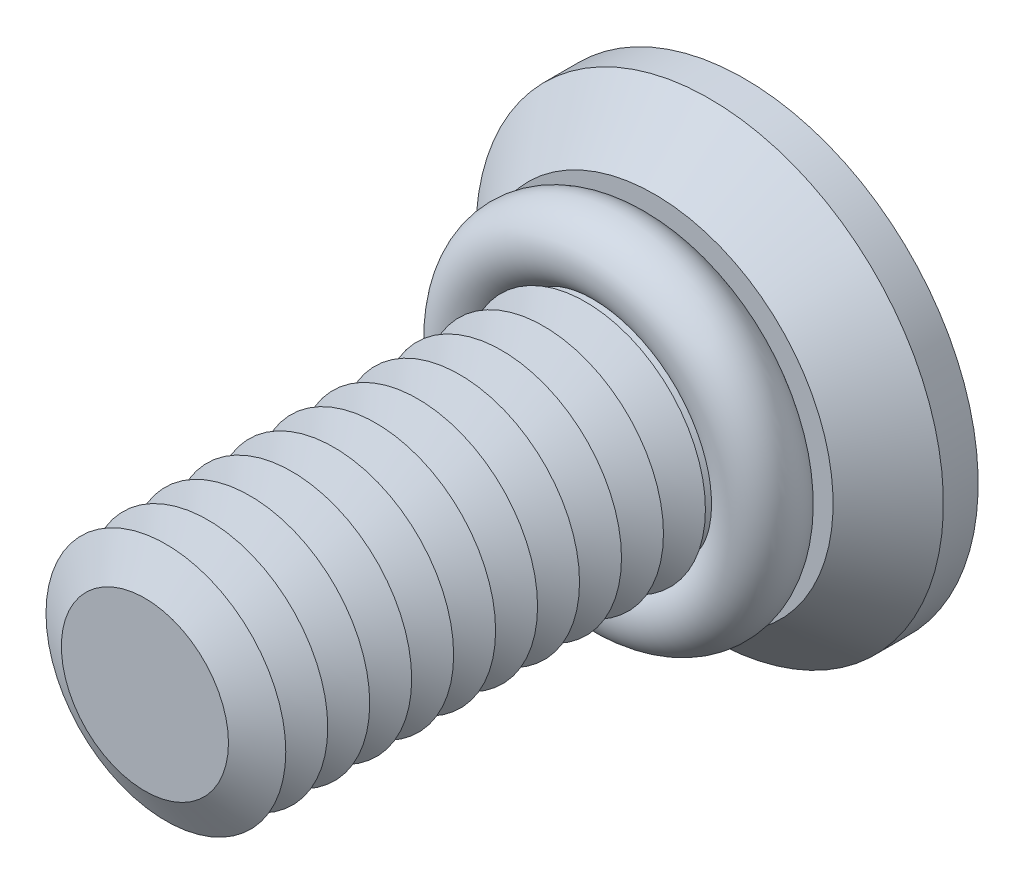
ISO-10303-21;
HEADER;
FILE_DESCRIPTION(('STEP AP214'),'2;1');
FILE_NAME('part.step','',(''),(''),'','','');
FILE_SCHEMA(('AUTOMOTIVE_DESIGN { 1 0 10303 214 1 1 1 1 }'));
ENDSEC;
DATA;
#1=APPLICATION_CONTEXT('core data for automotive mechanical design processes');
#2=APPLICATION_PROTOCOL_DEFINITION('international standard','automotive_design',2000,#1);
#3=PRODUCT_CONTEXT('',#1,'mechanical');
#4=PRODUCT('Part','Part','',(#3));
#5=PRODUCT_RELATED_PRODUCT_CATEGORY('part','',(#4));
#6=PRODUCT_DEFINITION_FORMATION('','',#4);
#7=PRODUCT_DEFINITION_CONTEXT('part definition',#1,'design');
#8=PRODUCT_DEFINITION('design','',#6,#7);
#9=PRODUCT_DEFINITION_SHAPE('','',#8);
#10=(LENGTH_UNIT() NAMED_UNIT(*) SI_UNIT(.MILLI.,.METRE.));
#11=(NAMED_UNIT(*) PLANE_ANGLE_UNIT() SI_UNIT($,.RADIAN.));
#12=(NAMED_UNIT(*) SI_UNIT($,.STERADIAN.) SOLID_ANGLE_UNIT());
#13=UNCERTAINTY_MEASURE_WITH_UNIT(LENGTH_MEASURE(1.E-05),#10,'distance_accuracy_value','');
#14=(GEOMETRIC_REPRESENTATION_CONTEXT(3) GLOBAL_UNCERTAINTY_ASSIGNED_CONTEXT((#13)) GLOBAL_UNIT_ASSIGNED_CONTEXT((#10,
#11,#12)) REPRESENTATION_CONTEXT('',''));
#15=CARTESIAN_POINT('',(0.,0.,0.));
#16=DIRECTION('',(0.,0.,1.));
#17=DIRECTION('',(1.,0.,0.));
#18=AXIS2_PLACEMENT_3D('',#15,#16,#17);
#19=CARTESIAN_POINT('',(0.,0.,2.1));
#20=DIRECTION('',(0.,0.,1.));
#21=DIRECTION('',(1.,0.,0.));
#22=AXIS2_PLACEMENT_3D('',#19,#20,#21);
#23=TOROIDAL_SURFACE('',#22,2.4,0.6);
#24=CARTESIAN_POINT('',(0.,2.4,2.1));
#25=DIRECTION('',(1.,0.,0.));
#26=DIRECTION('',(0.,0.,-1.));
#27=AXIS2_PLACEMENT_3D('',#24,#25,#26);
#28=CIRCLE('',#27,0.6);
#29=CARTESIAN_POINT('',(0.,3.,2.1));
#30=VERTEX_POINT('',#29);
#31=EDGE_CURVE('P0_E10',#30,#30,#28,.T.);
#32=CARTESIAN_POINT('',(0.,0.,2.1));
#33=DIRECTION('',(0.,0.,1.));
#34=DIRECTION('',(1.,0.,0.));
#35=AXIS2_PLACEMENT_3D('',#32,#33,#34);
#36=CIRCLE('',#35,3.);
#37=EDGE_CURVE('',#30,#30,#36,.T.);
#38=ORIENTED_EDGE('',*,*,#31,.F.);
#39=ORIENTED_EDGE('',*,*,#31,.T.);
#40=ORIENTED_EDGE('',*,*,#37,.T.);
#41=ORIENTED_EDGE('',*,*,#37,.F.);
#42=EDGE_LOOP('',(#38,#40,#39,#41));
#43=FACE_BOUND('',#42,.T.);
#44=ADVANCED_FACE('P0_F14',(#43),#23,.T.);
#45=CLOSED_SHELL('',(#44));
#46=MANIFOLD_SOLID_BREP('P0_B1',#45);
#47=CARTESIAN_POINT('',(0.,0.,6.5));
#48=DIRECTION('',(0.,0.,-1.));
#49=DIRECTION('',(-1.,0.,0.));
#50=AXIS2_PLACEMENT_3D('',#47,#48,#49);
#51=CONICAL_SURFACE('',#50,1.39378221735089,1.0471975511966);
#52=CARTESIAN_POINT('',(0.,0.,6.15));
#53=DIRECTION('',(0.,0.,1.));
#54=DIRECTION('',(1.,0.,0.));
#55=AXIS2_PLACEMENT_3D('',#52,#53,#54);
#56=CIRCLE('',#55,2.);
#57=CARTESIAN_POINT('',(2.,0.,6.15));
#58=VERTEX_POINT('',#57);
#59=EDGE_CURVE('P1_E324',#58,#58,#56,.T.);
#60=ORIENTED_EDGE('',*,*,#59,.T.);
#61=EDGE_LOOP('',(#60));
#62=FACE_BOUND('',#61,.T.);
#63=CARTESIAN_POINT('',(0.,0.,6.5));
#64=DIRECTION('',(0.,0.,1.));
#65=DIRECTION('',(1.,0.,0.));
#66=AXIS2_PLACEMENT_3D('',#63,#64,#65);
#67=CIRCLE('',#66,1.39378221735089);
#68=CARTESIAN_POINT('',(1.39378221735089,0.,6.5));
#69=VERTEX_POINT('',#68);
#70=EDGE_CURVE('P1_E321',#69,#69,#67,.T.);
#71=ORIENTED_EDGE('',*,*,#70,.F.);
#72=EDGE_LOOP('',(#71));
#73=FACE_BOUND('',#72,.T.);
#74=ADVANCED_FACE('P1_F15',(#62,#73),#51,.T.);
#75=CARTESIAN_POINT('',(0.,0.,6.85));
#76=DIRECTION('',(0.,0.,1.));
#77=DIRECTION('',(1.,0.,0.));
#78=AXIS2_PLACEMENT_3D('',#75,#76,#77);
#79=CONICAL_SURFACE('',#78,2.,1.0471975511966);
#80=ORIENTED_EDGE('',*,*,#70,.T.);
#81=EDGE_LOOP('',(#80));
#82=FACE_BOUND('',#81,.T.);
#83=CARTESIAN_POINT('',(0.,0.,6.85));
#84=DIRECTION('',(0.,0.,1.));
#85=DIRECTION('',(1.,0.,0.));
#86=AXIS2_PLACEMENT_3D('',#83,#84,#85);
#87=CIRCLE('',#86,2.);
#88=CARTESIAN_POINT('',(2.,0.,6.85));
#89=VERTEX_POINT('',#88);
#90=EDGE_CURVE('P1_E318',#89,#89,#87,.T.);
#91=ORIENTED_EDGE('',*,*,#90,.F.);
#92=EDGE_LOOP('',(#91));
#93=FACE_BOUND('',#92,.T.);
#94=ADVANCED_FACE('P1_F245',(#82,#93),#79,.T.);
#95=CARTESIAN_POINT('',(0.,0.,10.));
#96=DIRECTION('',(0.,0.,1.));
#97=DIRECTION('',(1.,0.,0.));
#98=AXIS2_PLACEMENT_3D('',#95,#96,#97);
#99=PLANE('',#98);
#100=CARTESIAN_POINT('',(0.,0.,10.));
#101=DIRECTION('',(0.,0.,1.));
#102=DIRECTION('',(1.,0.,0.));
#103=AXIS2_PLACEMENT_3D('',#100,#101,#102);
#104=CIRCLE('',#103,1.39378221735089);
#105=CARTESIAN_POINT('',(1.39378221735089,0.,10.));
#106=VERTEX_POINT('',#105);
#107=EDGE_CURVE('P1_E131',#106,#106,#104,.T.);
#108=ORIENTED_EDGE('',*,*,#107,.T.);
#109=EDGE_LOOP('',(#108));
#110=FACE_BOUND('',#109,.T.);
#111=ADVANCED_FACE('P1_F251',(#110),#99,.T.);
#112=CARTESIAN_POINT('',(0.,0.,10.));
#113=DIRECTION('',(0.,0.,-1.));
#114=DIRECTION('',(-1.,0.,0.));
#115=AXIS2_PLACEMENT_3D('',#112,#113,#114);
#116=CONICAL_SURFACE('',#115,1.39378221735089,1.0471975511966);
#117=CARTESIAN_POINT('',(0.,0.,9.65));
#118=DIRECTION('',(0.,0.,1.));
#119=DIRECTION('',(1.,0.,0.));
#120=AXIS2_PLACEMENT_3D('',#117,#118,#119);
#121=CIRCLE('',#120,2.);
#122=CARTESIAN_POINT('',(2.,0.,9.65));
#123=VERTEX_POINT('',#122);
#124=EDGE_CURVE('P1_E133',#123,#123,#121,.T.);
#125=ORIENTED_EDGE('',*,*,#124,.T.);
#126=EDGE_LOOP('',(#125));
#127=FACE_BOUND('',#126,.T.);
#128=ORIENTED_EDGE('',*,*,#107,.F.);
#129=EDGE_LOOP('',(#128));
#130=FACE_BOUND('',#129,.T.);
#131=ADVANCED_FACE('P1_F196',(#127,#130),#116,.T.);
#132=CARTESIAN_POINT('',(0.,0.,9.65));
#133=DIRECTION('',(0.,0.,1.));
#134=DIRECTION('',(1.,0.,0.));
#135=AXIS2_PLACEMENT_3D('',#132,#133,#134);
#136=CONICAL_SURFACE('',#135,2.,1.0471975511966);
#137=CARTESIAN_POINT('',(0.,0.,9.3));
#138=DIRECTION('',(0.,0.,1.));
#139=DIRECTION('',(1.,0.,0.));
#140=AXIS2_PLACEMENT_3D('',#137,#138,#139);
#141=CIRCLE('',#140,1.39378221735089);
#142=CARTESIAN_POINT('',(1.39378221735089,0.,9.3));
#143=VERTEX_POINT('',#142);
#144=EDGE_CURVE('P1_E297',#143,#143,#141,.T.);
#145=ORIENTED_EDGE('',*,*,#144,.T.);
#146=EDGE_LOOP('',(#145));
#147=FACE_BOUND('',#146,.T.);
#148=ORIENTED_EDGE('',*,*,#124,.F.);
#149=EDGE_LOOP('',(#148));
#150=FACE_BOUND('',#149,.T.);
#151=ADVANCED_FACE('P1_F284',(#147,#150),#136,.T.);
#152=CARTESIAN_POINT('',(0.,0.,9.3));
#153=DIRECTION('',(0.,0.,-1.));
#154=DIRECTION('',(-1.,0.,0.));
#155=AXIS2_PLACEMENT_3D('',#152,#153,#154);
#156=CONICAL_SURFACE('',#155,1.39378221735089,1.0471975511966);
#157=CARTESIAN_POINT('',(0.,0.,8.95));
#158=DIRECTION('',(0.,0.,1.));
#159=DIRECTION('',(1.,0.,0.));
#160=AXIS2_PLACEMENT_3D('',#157,#158,#159);
#161=CIRCLE('',#160,2.);
#162=CARTESIAN_POINT('',(2.,0.,8.95));
#163=VERTEX_POINT('',#162);
#164=EDGE_CURVE('P1_E294',#163,#163,#161,.T.);
#165=ORIENTED_EDGE('',*,*,#164,.T.);
#166=EDGE_LOOP('',(#165));
#167=FACE_BOUND('',#166,.T.);
#168=ORIENTED_EDGE('',*,*,#144,.F.);
#169=EDGE_LOOP('',(#168));
#170=FACE_BOUND('',#169,.T.);
#171=ADVANCED_FACE('P1_F279',(#167,#170),#156,.T.);
#172=CARTESIAN_POINT('',(0.,0.,8.95));
#173=DIRECTION('',(0.,0.,1.));
#174=DIRECTION('',(1.,0.,0.));
#175=AXIS2_PLACEMENT_3D('',#172,#173,#174);
#176=CONICAL_SURFACE('',#175,2.,1.0471975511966);
#177=CARTESIAN_POINT('',(0.,0.,8.6));
#178=DIRECTION('',(0.,0.,1.));
#179=DIRECTION('',(1.,0.,0.));
#180=AXIS2_PLACEMENT_3D('',#177,#178,#179);
#181=CIRCLE('',#180,1.39378221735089);
#182=CARTESIAN_POINT('',(1.39378221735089,0.,8.6));
#183=VERTEX_POINT('',#182);
#184=EDGE_CURVE('P1_E301',#183,#183,#181,.T.);
#185=ORIENTED_EDGE('',*,*,#184,.T.);
#186=EDGE_LOOP('',(#185));
#187=FACE_BOUND('',#186,.T.);
#188=ORIENTED_EDGE('',*,*,#164,.F.);
#189=EDGE_LOOP('',(#188));
#190=FACE_BOUND('',#189,.T.);
#191=ADVANCED_FACE('P1_F276',(#187,#190),#176,.T.);
#192=CARTESIAN_POINT('',(0.,0.,8.6));
#193=DIRECTION('',(0.,0.,-1.));
#194=DIRECTION('',(-1.,0.,0.));
#195=AXIS2_PLACEMENT_3D('',#192,#193,#194);
#196=CONICAL_SURFACE('',#195,1.39378221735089,1.0471975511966);
#197=CARTESIAN_POINT('',(0.,0.,8.25));
#198=DIRECTION('',(0.,0.,1.));
#199=DIRECTION('',(1.,0.,0.));
#200=AXIS2_PLACEMENT_3D('',#197,#198,#199);
#201=CIRCLE('',#200,2.);
#202=CARTESIAN_POINT('',(2.,0.,8.25));
#203=VERTEX_POINT('',#202);
#204=EDGE_CURVE('P1_E306',#203,#203,#201,.T.);
#205=ORIENTED_EDGE('',*,*,#204,.T.);
#206=EDGE_LOOP('',(#205));
#207=FACE_BOUND('',#206,.T.);
#208=ORIENTED_EDGE('',*,*,#184,.F.);
#209=EDGE_LOOP('',(#208));
#210=FACE_BOUND('',#209,.T.);
#211=ADVANCED_FACE('P1_F271',(#207,#210),#196,.T.);
#212=CARTESIAN_POINT('',(0.,0.,8.25));
#213=DIRECTION('',(0.,0.,1.));
#214=DIRECTION('',(1.,0.,0.));
#215=AXIS2_PLACEMENT_3D('',#212,#213,#214);
#216=CONICAL_SURFACE('',#215,2.,1.0471975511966);
#217=CARTESIAN_POINT('',(0.,0.,7.9));
#218=DIRECTION('',(0.,0.,1.));
#219=DIRECTION('',(1.,0.,0.));
#220=AXIS2_PLACEMENT_3D('',#217,#218,#219);
#221=CIRCLE('',#220,1.39378221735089);
#222=CARTESIAN_POINT('',(1.39378221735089,0.,7.9));
#223=VERTEX_POINT('',#222);
#224=EDGE_CURVE('P1_E309',#223,#223,#221,.T.);
#225=ORIENTED_EDGE('',*,*,#224,.T.);
#226=EDGE_LOOP('',(#225));
#227=FACE_BOUND('',#226,.T.);
#228=ORIENTED_EDGE('',*,*,#204,.F.);
#229=EDGE_LOOP('',(#228));
#230=FACE_BOUND('',#229,.T.);
#231=ADVANCED_FACE('P1_F268',(#227,#230),#216,.T.);
#232=CARTESIAN_POINT('',(0.,0.,7.9));
#233=DIRECTION('',(0.,0.,-1.));
#234=DIRECTION('',(-1.,0.,0.));
#235=AXIS2_PLACEMENT_3D('',#232,#233,#234);
#236=CONICAL_SURFACE('',#235,1.39378221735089,1.0471975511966);
#237=CARTESIAN_POINT('',(0.,0.,7.55));
#238=DIRECTION('',(0.,0.,1.));
#239=DIRECTION('',(1.,0.,0.));
#240=AXIS2_PLACEMENT_3D('',#237,#238,#239);
#241=CIRCLE('',#240,2.);
#242=CARTESIAN_POINT('',(2.,0.,7.55));
#243=VERTEX_POINT('',#242);
#244=EDGE_CURVE('P1_E312',#243,#243,#241,.T.);
#245=ORIENTED_EDGE('',*,*,#244,.T.);
#246=EDGE_LOOP('',(#245));
#247=FACE_BOUND('',#246,.T.);
#248=ORIENTED_EDGE('',*,*,#224,.F.);
#249=EDGE_LOOP('',(#248));
#250=FACE_BOUND('',#249,.T.);
#251=ADVANCED_FACE('P1_F262',(#247,#250),#236,.T.);
#252=CARTESIAN_POINT('',(0.,0.,7.55));
#253=DIRECTION('',(0.,0.,1.));
#254=DIRECTION('',(1.,0.,0.));
#255=AXIS2_PLACEMENT_3D('',#252,#253,#254);
#256=CONICAL_SURFACE('',#255,2.,1.0471975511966);
#257=CARTESIAN_POINT('',(0.,0.,7.2));
#258=DIRECTION('',(0.,0.,1.));
#259=DIRECTION('',(1.,0.,0.));
#260=AXIS2_PLACEMENT_3D('',#257,#258,#259);
#261=CIRCLE('',#260,1.39378221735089);
#262=CARTESIAN_POINT('',(1.39378221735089,0.,7.2));
#263=VERTEX_POINT('',#262);
#264=EDGE_CURVE('P1_E315',#263,#263,#261,.T.);
#265=ORIENTED_EDGE('',*,*,#264,.T.);
#266=EDGE_LOOP('',(#265));
#267=FACE_BOUND('',#266,.T.);
#268=ORIENTED_EDGE('',*,*,#244,.F.);
#269=EDGE_LOOP('',(#268));
#270=FACE_BOUND('',#269,.T.);
#271=ADVANCED_FACE('P1_F258',(#267,#270),#256,.T.);
#272=CARTESIAN_POINT('',(0.,0.,7.2));
#273=DIRECTION('',(0.,0.,-1.));
#274=DIRECTION('',(-1.,0.,0.));
#275=AXIS2_PLACEMENT_3D('',#272,#273,#274);
#276=CONICAL_SURFACE('',#275,1.39378221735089,1.0471975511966);
#277=ORIENTED_EDGE('',*,*,#90,.T.);
#278=EDGE_LOOP('',(#277));
#279=FACE_BOUND('',#278,.T.);
#280=ORIENTED_EDGE('',*,*,#264,.F.);
#281=EDGE_LOOP('',(#280));
#282=FACE_BOUND('',#281,.T.);
#283=ADVANCED_FACE('P1_F261',(#279,#282),#276,.T.);
#284=CARTESIAN_POINT('',(0.,0.,5.8));
#285=DIRECTION('',(0.,0.,-1.));
#286=DIRECTION('',(-1.,0.,0.));
#287=AXIS2_PLACEMENT_3D('',#284,#285,#286);
#288=CONICAL_SURFACE('',#287,1.39378221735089,1.0471975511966);
#289=CARTESIAN_POINT('',(0.,0.,5.45));
#290=DIRECTION('',(0.,0.,1.));
#291=DIRECTION('',(1.,0.,0.));
#292=AXIS2_PLACEMENT_3D('',#289,#290,#291);
#293=CIRCLE('',#292,2.);
#294=CARTESIAN_POINT('',(2.,0.,5.45));
#295=VERTEX_POINT('',#294);
#296=EDGE_CURVE('P1_E329',#295,#295,#293,.T.);
#297=ORIENTED_EDGE('',*,*,#296,.T.);
#298=EDGE_LOOP('',(#297));
#299=FACE_BOUND('',#298,.T.);
#300=CARTESIAN_POINT('',(0.,0.,5.8));
#301=DIRECTION('',(0.,0.,1.));
#302=DIRECTION('',(1.,0.,0.));
#303=AXIS2_PLACEMENT_3D('',#300,#301,#302);
#304=CIRCLE('',#303,1.39378221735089);
#305=CARTESIAN_POINT('',(1.39378221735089,0.,5.8));
#306=VERTEX_POINT('',#305);
#307=EDGE_CURVE('P1_E326',#306,#306,#304,.T.);
#308=ORIENTED_EDGE('',*,*,#307,.F.);
#309=EDGE_LOOP('',(#308));
#310=FACE_BOUND('',#309,.T.);
#311=ADVANCED_FACE('P1_F266',(#299,#310),#288,.T.);
#312=CARTESIAN_POINT('',(0.,0.,6.15));
#313=DIRECTION('',(0.,0.,1.));
#314=DIRECTION('',(1.,0.,0.));
#315=AXIS2_PLACEMENT_3D('',#312,#313,#314);
#316=CONICAL_SURFACE('',#315,2.,1.0471975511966);
#317=ORIENTED_EDGE('',*,*,#307,.T.);
#318=EDGE_LOOP('',(#317));
#319=FACE_BOUND('',#318,.T.);
#320=ORIENTED_EDGE('',*,*,#59,.F.);
#321=EDGE_LOOP('',(#320));
#322=FACE_BOUND('',#321,.T.);
#323=ADVANCED_FACE('P1_F461',(#319,#322),#316,.T.);
#324=CARTESIAN_POINT('',(0.,0.,5.1));
#325=DIRECTION('',(0.,0.,-1.));
#326=DIRECTION('',(-1.,0.,0.));
#327=AXIS2_PLACEMENT_3D('',#324,#325,#326);
#328=CONICAL_SURFACE('',#327,1.39378221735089,1.0471975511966);
#329=CARTESIAN_POINT('',(0.,0.,4.75));
#330=DIRECTION('',(0.,0.,1.));
#331=DIRECTION('',(1.,0.,0.));
#332=AXIS2_PLACEMENT_3D('',#329,#330,#331);
#333=CIRCLE('',#332,2.);
#334=CARTESIAN_POINT('',(2.,0.,4.75));
#335=VERTEX_POINT('',#334);
#336=EDGE_CURVE('P1_E335',#335,#335,#333,.T.);
#337=ORIENTED_EDGE('',*,*,#336,.T.);
#338=EDGE_LOOP('',(#337));
#339=FACE_BOUND('',#338,.T.);
#340=CARTESIAN_POINT('',(0.,0.,5.1));
#341=DIRECTION('',(0.,0.,1.));
#342=DIRECTION('',(1.,0.,0.));
#343=AXIS2_PLACEMENT_3D('',#340,#341,#342);
#344=CIRCLE('',#343,1.39378221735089);
#345=CARTESIAN_POINT('',(1.39378221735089,0.,5.1));
#346=VERTEX_POINT('',#345);
#347=EDGE_CURVE('P1_E332',#346,#346,#344,.T.);
#348=ORIENTED_EDGE('',*,*,#347,.F.);
#349=EDGE_LOOP('',(#348));
#350=FACE_BOUND('',#349,.T.);
#351=ADVANCED_FACE('P1_F470',(#339,#350),#328,.T.);
#352=CARTESIAN_POINT('',(0.,0.,5.45));
#353=DIRECTION('',(0.,0.,1.));
#354=DIRECTION('',(1.,0.,0.));
#355=AXIS2_PLACEMENT_3D('',#352,#353,#354);
#356=CONICAL_SURFACE('',#355,2.,1.0471975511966);
#357=ORIENTED_EDGE('',*,*,#347,.T.);
#358=EDGE_LOOP('',(#357));
#359=FACE_BOUND('',#358,.T.);
#360=ORIENTED_EDGE('',*,*,#296,.F.);
#361=EDGE_LOOP('',(#360));
#362=FACE_BOUND('',#361,.T.);
#363=ADVANCED_FACE('P1_F480',(#359,#362),#356,.T.);
#364=CARTESIAN_POINT('',(0.,0.,4.4));
#365=DIRECTION('',(0.,0.,-1.));
#366=DIRECTION('',(-1.,0.,0.));
#367=AXIS2_PLACEMENT_3D('',#364,#365,#366);
#368=CONICAL_SURFACE('',#367,1.39378221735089,1.0471975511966);
#369=CARTESIAN_POINT('',(0.,0.,4.05));
#370=DIRECTION('',(0.,0.,1.));
#371=DIRECTION('',(1.,0.,0.));
#372=AXIS2_PLACEMENT_3D('',#369,#370,#371);
#373=CIRCLE('',#372,2.);
#374=CARTESIAN_POINT('',(2.,0.,4.05));
#375=VERTEX_POINT('',#374);
#376=EDGE_CURVE('P1_E341',#375,#375,#373,.T.);
#377=ORIENTED_EDGE('',*,*,#376,.T.);
#378=EDGE_LOOP('',(#377));
#379=FACE_BOUND('',#378,.T.);
#380=CARTESIAN_POINT('',(0.,0.,4.4));
#381=DIRECTION('',(0.,0.,1.));
#382=DIRECTION('',(1.,0.,0.));
#383=AXIS2_PLACEMENT_3D('',#380,#381,#382);
#384=CIRCLE('',#383,1.39378221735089);
#385=CARTESIAN_POINT('',(1.39378221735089,0.,4.4));
#386=VERTEX_POINT('',#385);
#387=EDGE_CURVE('P1_E338',#386,#386,#384,.T.);
#388=ORIENTED_EDGE('',*,*,#387,.F.);
#389=EDGE_LOOP('',(#388));
#390=FACE_BOUND('',#389,.T.);
#391=ADVANCED_FACE('P1_F490',(#379,#390),#368,.T.);
#392=CARTESIAN_POINT('',(0.,0.,4.75));
#393=DIRECTION('',(0.,0.,1.));
#394=DIRECTION('',(1.,0.,0.));
#395=AXIS2_PLACEMENT_3D('',#392,#393,#394);
#396=CONICAL_SURFACE('',#395,2.,1.0471975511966);
#397=ORIENTED_EDGE('',*,*,#387,.T.);
#398=EDGE_LOOP('',(#397));
#399=FACE_BOUND('',#398,.T.);
#400=ORIENTED_EDGE('',*,*,#336,.F.);
#401=EDGE_LOOP('',(#400));
#402=FACE_BOUND('',#401,.T.);
#403=ADVANCED_FACE('P1_F500',(#399,#402),#396,.T.);
#404=CARTESIAN_POINT('',(0.,0.,3.7));
#405=DIRECTION('',(0.,0.,-1.));
#406=DIRECTION('',(-1.,0.,0.));
#407=AXIS2_PLACEMENT_3D('',#404,#405,#406);
#408=CONICAL_SURFACE('',#407,1.39378221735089,1.0471975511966);
#409=CARTESIAN_POINT('',(0.,0.,3.35));
#410=DIRECTION('',(0.,0.,1.));
#411=DIRECTION('',(1.,0.,0.));
#412=AXIS2_PLACEMENT_3D('',#409,#410,#411);
#413=CIRCLE('',#412,2.);
#414=CARTESIAN_POINT('',(2.,0.,3.35));
#415=VERTEX_POINT('',#414);
#416=EDGE_CURVE('P1_E347',#415,#415,#413,.T.);
#417=ORIENTED_EDGE('',*,*,#416,.T.);
#418=EDGE_LOOP('',(#417));
#419=FACE_BOUND('',#418,.T.);
#420=CARTESIAN_POINT('',(0.,0.,3.7));
#421=DIRECTION('',(0.,0.,1.));
#422=DIRECTION('',(1.,0.,0.));
#423=AXIS2_PLACEMENT_3D('',#420,#421,#422);
#424=CIRCLE('',#423,1.39378221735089);
#425=CARTESIAN_POINT('',(1.39378221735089,0.,3.7));
#426=VERTEX_POINT('',#425);
#427=EDGE_CURVE('P1_E344',#426,#426,#424,.T.);
#428=ORIENTED_EDGE('',*,*,#427,.F.);
#429=EDGE_LOOP('',(#428));
#430=FACE_BOUND('',#429,.T.);
#431=ADVANCED_FACE('P1_F510',(#419,#430),#408,.T.);
#432=CARTESIAN_POINT('',(0.,0.,4.05));
#433=DIRECTION('',(0.,0.,1.));
#434=DIRECTION('',(1.,0.,0.));
#435=AXIS2_PLACEMENT_3D('',#432,#433,#434);
#436=CONICAL_SURFACE('',#435,2.,1.0471975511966);
#437=ORIENTED_EDGE('',*,*,#427,.T.);
#438=EDGE_LOOP('',(#437));
#439=FACE_BOUND('',#438,.T.);
#440=ORIENTED_EDGE('',*,*,#376,.F.);
#441=EDGE_LOOP('',(#440));
#442=FACE_BOUND('',#441,.T.);
#443=ADVANCED_FACE('P1_F520',(#439,#442),#436,.T.);
#444=CARTESIAN_POINT('',(0.,0.,3.));
#445=DIRECTION('',(0.,0.,-1.));
#446=DIRECTION('',(-1.,0.,0.));
#447=AXIS2_PLACEMENT_3D('',#444,#445,#446);
#448=CONICAL_SURFACE('',#447,1.39378221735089,1.0471975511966);
#449=CARTESIAN_POINT('',(0.,0.,2.65));
#450=DIRECTION('',(0.,0.,1.));
#451=DIRECTION('',(1.,0.,0.));
#452=AXIS2_PLACEMENT_3D('',#449,#450,#451);
#453=CIRCLE('',#452,2.);
#454=CARTESIAN_POINT('',(2.,0.,2.65));
#455=VERTEX_POINT('',#454);
#456=EDGE_CURVE('P1_E353',#455,#455,#453,.T.);
#457=ORIENTED_EDGE('',*,*,#456,.T.);
#458=EDGE_LOOP('',(#457));
#459=FACE_BOUND('',#458,.T.);
#460=CARTESIAN_POINT('',(0.,0.,3.));
#461=DIRECTION('',(0.,0.,1.));
#462=DIRECTION('',(1.,0.,0.));
#463=AXIS2_PLACEMENT_3D('',#460,#461,#462);
#464=CIRCLE('',#463,1.39378221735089);
#465=CARTESIAN_POINT('',(1.39378221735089,0.,3.));
#466=VERTEX_POINT('',#465);
#467=EDGE_CURVE('P1_E350',#466,#466,#464,.T.);
#468=ORIENTED_EDGE('',*,*,#467,.F.);
#469=EDGE_LOOP('',(#468));
#470=FACE_BOUND('',#469,.T.);
#471=ADVANCED_FACE('P1_F530',(#459,#470),#448,.T.);
#472=CARTESIAN_POINT('',(0.,0.,3.35));
#473=DIRECTION('',(0.,0.,1.));
#474=DIRECTION('',(1.,0.,0.));
#475=AXIS2_PLACEMENT_3D('',#472,#473,#474);
#476=CONICAL_SURFACE('',#475,2.,1.0471975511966);
#477=ORIENTED_EDGE('',*,*,#467,.T.);
#478=EDGE_LOOP('',(#477));
#479=FACE_BOUND('',#478,.T.);
#480=ORIENTED_EDGE('',*,*,#416,.F.);
#481=EDGE_LOOP('',(#480));
#482=FACE_BOUND('',#481,.T.);
#483=ADVANCED_FACE('P1_F366',(#479,#482),#476,.T.);
#484=CARTESIAN_POINT('',(0.,0.,2.3));
#485=DIRECTION('',(0.,0.,-1.));
#486=DIRECTION('',(-1.,0.,0.));
#487=AXIS2_PLACEMENT_3D('',#484,#485,#486);
#488=CONICAL_SURFACE('',#487,1.39378221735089,1.0471975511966);
#489=CARTESIAN_POINT('',(0.,0.,2.3));
#490=DIRECTION('',(0.,0.,1.));
#491=DIRECTION('',(1.,0.,0.));
#492=AXIS2_PLACEMENT_3D('',#489,#490,#491);
#493=CIRCLE('',#492,1.39378221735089);
#494=CARTESIAN_POINT('',(1.39378221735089,0.,2.3));
#495=VERTEX_POINT('',#494);
#496=EDGE_CURVE('P1_E356',#495,#495,#493,.T.);
#497=ORIENTED_EDGE('',*,*,#496,.F.);
#498=EDGE_LOOP('',(#497));
#499=FACE_BOUND('',#498,.T.);
#500=CARTESIAN_POINT('',(0.,0.,2.06547005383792));
#501=DIRECTION('',(0.,0.,-1.));
#502=DIRECTION('',(-1.,0.,0.));
#503=AXIS2_PLACEMENT_3D('',#500,#501,#502);
#504=CIRCLE('',#503,1.8);
#505=CARTESIAN_POINT('',(-1.8,0.,2.06547005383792));
#506=VERTEX_POINT('',#505);
#507=EDGE_CURVE('P1_E19',#506,#506,#504,.F.);
#508=ORIENTED_EDGE('',*,*,#507,.T.);
#509=EDGE_LOOP('',(#508));
#510=FACE_BOUND('',#509,.T.);
#511=ADVANCED_FACE('P1_F363',(#499,#510),#488,.T.);
#512=CARTESIAN_POINT('',(0.,0.,2.65));
#513=DIRECTION('',(0.,0.,1.));
#514=DIRECTION('',(1.,0.,0.));
#515=AXIS2_PLACEMENT_3D('',#512,#513,#514);
#516=CONICAL_SURFACE('',#515,2.,1.0471975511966);
#517=ORIENTED_EDGE('',*,*,#496,.T.);
#518=EDGE_LOOP('',(#517));
#519=FACE_BOUND('',#518,.T.);
#520=ORIENTED_EDGE('',*,*,#456,.F.);
#521=EDGE_LOOP('',(#520));
#522=FACE_BOUND('',#521,.T.);
#523=ADVANCED_FACE('P1_F360',(#519,#522),#516,.T.);
#524=CARTESIAN_POINT('',(0.,0.,1.5));
#525=DIRECTION('',(0.,0.,-1.));
#526=DIRECTION('',(-1.,0.,0.));
#527=AXIS2_PLACEMENT_3D('',#524,#525,#526);
#528=CONICAL_SURFACE('',#527,1.25,1.0471975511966);
#529=CARTESIAN_POINT('',(0.,0.,2.22168783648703));
#530=VERTEX_POINT('',#529);
#531=VERTEX_LOOP('',#530);
#532=FACE_BOUND('',#531,.T.);
#533=CARTESIAN_POINT('',(0.,0.,1.5));
#534=DIRECTION('',(0.,0.,-1.));
#535=DIRECTION('',(-1.,0.,0.));
#536=AXIS2_PLACEMENT_3D('',#533,#534,#535);
#537=CIRCLE('',#536,1.25);
#538=CARTESIAN_POINT('',(-1.25,0.,1.5));
#539=VERTEX_POINT('',#538);
#540=CARTESIAN_POINT('',(-0.625,1.08253175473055,1.5));
#541=VERTEX_POINT('',#540);
#542=EDGE_CURVE('P1_E117',#539,#541,#537,.T.);
#543=ORIENTED_EDGE('',*,*,#542,.T.);
#544=CARTESIAN_POINT('',(0.,0.,1.5));
#545=DIRECTION('',(0.,0.,-1.));
#546=DIRECTION('',(-1.,0.,0.));
#547=AXIS2_PLACEMENT_3D('',#544,#545,#546);
#548=CIRCLE('',#547,1.25);
#549=CARTESIAN_POINT('',(0.625,1.08253175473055,1.5));
#550=VERTEX_POINT('',#549);
#551=EDGE_CURVE('P1_E24',#541,#550,#548,.T.);
#552=ORIENTED_EDGE('',*,*,#551,.T.);
#553=CARTESIAN_POINT('',(1.25,0.,1.5));
#554=VERTEX_POINT('',#553);
#555=EDGE_CURVE('P1_E765',#550,#554,#548,.T.);
#556=ORIENTED_EDGE('',*,*,#555,.T.);
#557=CARTESIAN_POINT('',(0.625,-1.08253175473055,1.5));
#558=VERTEX_POINT('',#557);
#559=EDGE_CURVE('P1_E758',#554,#558,#548,.T.);
#560=ORIENTED_EDGE('',*,*,#559,.T.);
#561=CARTESIAN_POINT('',(-0.625,-1.08253175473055,1.5));
#562=VERTEX_POINT('',#561);
#563=EDGE_CURVE('P1_E182',#558,#562,#548,.T.);
#564=ORIENTED_EDGE('',*,*,#563,.T.);
#565=EDGE_CURVE('P1_E179',#562,#539,#548,.T.);
#566=ORIENTED_EDGE('',*,*,#565,.T.);
#567=EDGE_LOOP('',(#543,#552,#556,#560,#564,#566));
#568=FACE_BOUND('',#567,.T.);
#569=ADVANCED_FACE('P1_F198',(#532,#568),#528,.F.);
#570=CARTESIAN_POINT('',(0.,0.,1.5));
#571=DIRECTION('',(0.,0.,-1.));
#572=DIRECTION('',(-1.,0.,0.));
#573=AXIS2_PLACEMENT_3D('',#570,#571,#572);
#574=PLANE('',#573);
#575=ORIENTED_EDGE('',*,*,#563,.F.);
#576=DIRECTION('',(-0.866025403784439,-0.5,0.));
#577=VECTOR('',#576,1.);
#578=CARTESIAN_POINT('',(1.25,-0.721687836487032,1.5));
#579=LINE('',#578,#577);
#580=CARTESIAN_POINT('',(0.,-1.44337567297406,1.5));
#581=VERTEX_POINT('',#580);
#582=EDGE_CURVE('P1_E774',#558,#581,#579,.T.);
#583=ORIENTED_EDGE('',*,*,#582,.T.);
#584=DIRECTION('',(-0.866025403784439,0.5,0.));
#585=VECTOR('',#584,1.);
#586=CARTESIAN_POINT('',(0.,-1.44337567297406,1.5));
#587=LINE('',#586,#585);
#588=EDGE_CURVE('P1_E781',#581,#562,#587,.T.);
#589=ORIENTED_EDGE('',*,*,#588,.T.);
#590=EDGE_LOOP('',(#575,#583,#589));
#591=FACE_BOUND('',#590,.T.);
#592=ADVANCED_FACE('P1_F572',(#591),#574,.T.);
#593=ORIENTED_EDGE('',*,*,#565,.F.);
#594=CARTESIAN_POINT('',(-1.25,-0.721687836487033,1.5));
#595=VERTEX_POINT('',#594);
#596=EDGE_CURVE('P1_E784',#562,#595,#587,.T.);
#597=ORIENTED_EDGE('',*,*,#596,.T.);
#598=DIRECTION('',(0.,1.,0.));
#599=VECTOR('',#598,1.);
#600=CARTESIAN_POINT('',(-1.25,-0.721687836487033,1.5));
#601=LINE('',#600,#599);
#602=EDGE_CURVE('P1_E123',#595,#539,#601,.T.);
#603=ORIENTED_EDGE('',*,*,#602,.T.);
#604=EDGE_LOOP('',(#593,#597,#603));
#605=FACE_BOUND('',#604,.T.);
#606=ADVANCED_FACE('P1_F231',(#605),#574,.T.);
#607=ORIENTED_EDGE('',*,*,#542,.F.);
#608=CARTESIAN_POINT('',(-1.25,0.721687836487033,1.5));
#609=VERTEX_POINT('',#608);
#610=EDGE_CURVE('P1_E786',#539,#609,#601,.T.);
#611=ORIENTED_EDGE('',*,*,#610,.T.);
#612=DIRECTION('',(0.866025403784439,0.5,0.));
#613=VECTOR('',#612,1.);
#614=CARTESIAN_POINT('',(-1.25,0.721687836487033,1.5));
#615=LINE('',#614,#613);
#616=EDGE_CURVE('P1_E789',#609,#541,#615,.T.);
#617=ORIENTED_EDGE('',*,*,#616,.T.);
#618=EDGE_LOOP('',(#607,#611,#617));
#619=FACE_BOUND('',#618,.T.);
#620=ADVANCED_FACE('P1_F589',(#619),#574,.T.);
#621=ORIENTED_EDGE('',*,*,#551,.F.);
#622=CARTESIAN_POINT('',(0.,1.44337567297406,1.5));
#623=VERTEX_POINT('',#622);
#624=EDGE_CURVE('P1_E788',#541,#623,#615,.T.);
#625=ORIENTED_EDGE('',*,*,#624,.T.);
#626=DIRECTION('',(0.866025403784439,-0.5,0.));
#627=VECTOR('',#626,1.);
#628=CARTESIAN_POINT('',(0.,1.44337567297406,1.5));
#629=LINE('',#628,#627);
#630=EDGE_CURVE('P1_E161',#623,#550,#629,.T.);
#631=ORIENTED_EDGE('',*,*,#630,.T.);
#632=EDGE_LOOP('',(#621,#625,#631));
#633=FACE_BOUND('',#632,.T.);
#634=ADVANCED_FACE('P1_F598',(#633),#574,.T.);
#635=ORIENTED_EDGE('',*,*,#555,.F.);
#636=CARTESIAN_POINT('',(1.25,0.721687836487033,1.5));
#637=VERTEX_POINT('',#636);
#638=EDGE_CURVE('P1_E773',#550,#637,#629,.T.);
#639=ORIENTED_EDGE('',*,*,#638,.T.);
#640=DIRECTION('',(0.,-1.,0.));
#641=VECTOR('',#640,1.);
#642=CARTESIAN_POINT('',(1.25,0.721687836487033,1.5));
#643=LINE('',#642,#641);
#644=EDGE_CURVE('P1_E768',#637,#554,#643,.T.);
#645=ORIENTED_EDGE('',*,*,#644,.T.);
#646=EDGE_LOOP('',(#635,#639,#645));
#647=FACE_BOUND('',#646,.T.);
#648=ADVANCED_FACE('P1_F607',(#647),#574,.T.);
#649=ORIENTED_EDGE('',*,*,#559,.F.);
#650=CARTESIAN_POINT('',(1.25,-0.721687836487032,1.5));
#651=VERTEX_POINT('',#650);
#652=EDGE_CURVE('P1_E760',#554,#651,#643,.T.);
#653=ORIENTED_EDGE('',*,*,#652,.T.);
#654=EDGE_CURVE('P1_E125',#651,#558,#579,.T.);
#655=ORIENTED_EDGE('',*,*,#654,.T.);
#656=EDGE_LOOP('',(#649,#653,#655));
#657=FACE_BOUND('',#656,.T.);
#658=ADVANCED_FACE('P1_F229',(#657),#574,.T.);
#659=CARTESIAN_POINT('',(1.25,-0.721687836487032,1.5));
#660=DIRECTION('',(0.5,-0.866025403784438,0.));
#661=DIRECTION('',(0.866025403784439,0.5,0.));
#662=AXIS2_PLACEMENT_3D('',#659,#660,#661);
#663=PLANE('',#662);
#664=DIRECTION('',(0.,0.,-1.));
#665=VECTOR('',#664,1.);
#666=CARTESIAN_POINT('',(1.25,-0.721687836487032,1.5));
#667=LINE('',#666,#665);
#668=CARTESIAN_POINT('',(1.25,-0.721687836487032,0.));
#669=VERTEX_POINT('',#668);
#670=EDGE_CURVE('P1_E164',#651,#669,#667,.T.);
#671=ORIENTED_EDGE('',*,*,#670,.T.);
#672=CARTESIAN_POINT('',(1.2502,-0.721572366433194,-3.09438201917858E-05));
#673=CARTESIAN_POINT('',(1.19827409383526,-0.75155180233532,0.00800698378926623));
#674=CARTESIAN_POINT('',(1.14625401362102,-0.781585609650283,0.0153042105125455));
#675=CARTESIAN_POINT('',(1.04203006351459,-0.841759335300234,0.028124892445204));
#676=CARTESIAN_POINT('',(0.989826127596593,-0.871899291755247,0.0336476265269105));
#677=CARTESIAN_POINT('',(0.88555111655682,-0.932102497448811,0.0425967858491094));
#678=CARTESIAN_POINT('',(0.833480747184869,-0.96216533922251,0.0460338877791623));
#679=CARTESIAN_POINT('',(0.729273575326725,-1.0223293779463,0.0506427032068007));
#680=CARTESIAN_POINT('',(0.677136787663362,-1.05243056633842,0.0518148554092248));
#681=CARTESIAN_POINT('',(0.572863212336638,-1.11263294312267,0.0518148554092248));
#682=CARTESIAN_POINT('',(0.520726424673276,-1.1427341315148,0.0506427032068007));
#683=CARTESIAN_POINT('',(0.416519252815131,-1.20289817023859,0.0460338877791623));
#684=CARTESIAN_POINT('',(0.36444888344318,-1.23296101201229,0.0425967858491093));
#685=CARTESIAN_POINT('',(0.260173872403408,-1.29316421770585,0.0336476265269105));
#686=CARTESIAN_POINT('',(0.207969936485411,-1.32330417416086,0.028124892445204));
#687=CARTESIAN_POINT('',(0.103745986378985,-1.38347789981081,0.0153042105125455));
#688=CARTESIAN_POINT('',(0.0517259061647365,-1.41351170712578,0.00800698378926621));
#689=CARTESIAN_POINT('',(-0.000199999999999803,-1.4434911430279,-3.09438201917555E-05));
#690=B_SPLINE_CURVE_WITH_KNOTS('',3,(#672,#673,#674,#675,#676,#677,#678,#679,#680,#681,#682,
#683,#684,#685,#686,#687,#688,#689),.UNSPECIFIED.,.F.,.F.,(4,2,2,2,2,2,2,2,4),(0.,
0.18149525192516,0.363064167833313,0.543695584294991,0.724292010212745,0.904888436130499,
1.08551985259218,1.26708876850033,1.44858402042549),.UNSPECIFIED.);
#691=CARTESIAN_POINT('',(0.,-1.44337567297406,0.));
#692=VERTEX_POINT('',#691);
#693=EDGE_CURVE('P1_E118',#669,#692,#690,.T.);
#694=ORIENTED_EDGE('',*,*,#693,.T.);
#695=DIRECTION('',(0.,0.,-1.));
#696=VECTOR('',#695,1.);
#697=CARTESIAN_POINT('',(0.,-1.44337567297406,1.5));
#698=LINE('',#697,#696);
#699=EDGE_CURVE('P1_E116',#581,#692,#698,.T.);
#700=ORIENTED_EDGE('',*,*,#699,.F.);
#701=ORIENTED_EDGE('',*,*,#582,.F.);
#702=ORIENTED_EDGE('',*,*,#654,.F.);
#703=EDGE_LOOP('',(#671,#694,#700,#701,#702));
#704=FACE_BOUND('',#703,.T.);
#705=ADVANCED_FACE('P1_F226',(#704),#663,.F.);
#706=CARTESIAN_POINT('',(0.,-1.44337567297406,1.5));
#707=DIRECTION('',(-0.5,-0.866025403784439,0.));
#708=DIRECTION('',(0.866025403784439,-0.5,0.));
#709=AXIS2_PLACEMENT_3D('',#706,#707,#708);
#710=PLANE('',#709);
#711=ORIENTED_EDGE('',*,*,#699,.T.);
#712=CARTESIAN_POINT('',(0.000200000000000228,-1.4434911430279,-3.094382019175E-05));
#713=CARTESIAN_POINT('',(-0.0517259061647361,-1.41351170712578,0.00800698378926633));
#714=CARTESIAN_POINT('',(-0.103745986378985,-1.38347789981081,0.0153042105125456));
#715=CARTESIAN_POINT('',(-0.207969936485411,-1.32330417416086,0.028124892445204));
#716=CARTESIAN_POINT('',(-0.260173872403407,-1.29316421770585,0.0336476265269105));
#717=CARTESIAN_POINT('',(-0.36444888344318,-1.23296101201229,0.0425967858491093));
#718=CARTESIAN_POINT('',(-0.416519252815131,-1.20289817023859,0.0460338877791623));
#719=CARTESIAN_POINT('',(-0.520726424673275,-1.1427341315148,0.0506427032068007));
#720=CARTESIAN_POINT('',(-0.572863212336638,-1.11263294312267,0.0518148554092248));
#721=CARTESIAN_POINT('',(-0.677136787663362,-1.05243056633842,0.0518148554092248));
#722=CARTESIAN_POINT('',(-0.729273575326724,-1.0223293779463,0.0506427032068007));
#723=CARTESIAN_POINT('',(-0.833480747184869,-0.96216533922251,0.0460338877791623));
#724=CARTESIAN_POINT('',(-0.88555111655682,-0.932102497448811,0.0425967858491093));
#725=CARTESIAN_POINT('',(-0.989826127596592,-0.871899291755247,0.0336476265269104));
#726=CARTESIAN_POINT('',(-1.04203006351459,-0.841759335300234,0.028124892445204));
#727=CARTESIAN_POINT('',(-1.14625401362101,-0.781585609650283,0.0153042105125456));
#728=CARTESIAN_POINT('',(-1.19827409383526,-0.751551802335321,0.00800698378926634));
#729=CARTESIAN_POINT('',(-1.2502,-0.721572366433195,-3.09438201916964E-05));
#730=B_SPLINE_CURVE_WITH_KNOTS('',3,(#712,#713,#714,#715,#716,#717,#718,#719,#720,#721,#722,
#723,#724,#725,#726,#727,#728,#729),.UNSPECIFIED.,.F.,.F.,(4,2,2,2,2,2,2,2,4),(0.,
0.18149525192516,0.363064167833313,0.543695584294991,0.724292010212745,0.904888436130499,
1.08551985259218,1.26708876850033,1.44858402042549),.UNSPECIFIED.);
#731=CARTESIAN_POINT('',(-1.25,-0.721687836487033,0.));
#732=VERTEX_POINT('',#731);
#733=EDGE_CURVE('P1_E94',#692,#732,#730,.T.);
#734=ORIENTED_EDGE('',*,*,#733,.T.);
#735=DIRECTION('',(0.,0.,-1.));
#736=VECTOR('',#735,1.);
#737=CARTESIAN_POINT('',(-1.25,-0.721687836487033,1.5));
#738=LINE('',#737,#736);
#739=EDGE_CURVE('P1_E112',#595,#732,#738,.T.);
#740=ORIENTED_EDGE('',*,*,#739,.F.);
#741=ORIENTED_EDGE('',*,*,#596,.F.);
#742=ORIENTED_EDGE('',*,*,#588,.F.);
#743=EDGE_LOOP('',(#711,#734,#740,#741,#742));
#744=FACE_BOUND('',#743,.T.);
#745=ADVANCED_FACE('P1_F110',(#744),#710,.F.);
#746=CARTESIAN_POINT('',(-1.25,-0.721687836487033,1.5));
#747=DIRECTION('',(-1.,0.,0.));
#748=DIRECTION('',(0.,0.,1.));
#749=AXIS2_PLACEMENT_3D('',#746,#747,#748);
#750=PLANE('',#749);
#751=ORIENTED_EDGE('',*,*,#739,.T.);
#752=CARTESIAN_POINT('',(-1.25,-1.88400474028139,-0.219073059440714));
#753=CARTESIAN_POINT('',(-1.25,-1.82756112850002,-0.206472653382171));
#754=CARTESIAN_POINT('',(-1.25,-1.77108164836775,-0.194032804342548));
#755=CARTESIAN_POINT('',(-1.25,-1.65803301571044,-0.169555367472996));
#756=CARTESIAN_POINT('',(-1.25,-1.60146385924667,-0.157517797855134));
#757=CARTESIAN_POINT('',(-1.25,-1.43148763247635,-0.122107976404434));
#758=CARTESIAN_POINT('',(-1.25,-1.31792638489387,-0.0994645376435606));
#759=CARTESIAN_POINT('',(-1.25,-1.09123200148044,-0.057323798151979));
#760=CARTESIAN_POINT('',(-1.25,-0.978103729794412,-0.0378008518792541));
#761=CARTESIAN_POINT('',(-1.25,-0.751170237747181,-0.00320860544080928));
#762=CARTESIAN_POINT('',(-1.25,-0.637365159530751,0.0118615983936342));
#763=CARTESIAN_POINT('',(-1.25,-0.407744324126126,0.0355899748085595));
#764=CARTESIAN_POINT('',(-1.25,-0.291920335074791,0.0441742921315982));
#765=CARTESIAN_POINT('',(-1.25,-0.117976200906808,0.0506819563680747));
#766=CARTESIAN_POINT('',(-1.25,-0.059969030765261,0.0517900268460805));
#767=CARTESIAN_POINT('',(-1.25,0.0560463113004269,0.051838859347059));
#768=CARTESIAN_POINT('',(-1.25,0.114054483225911,0.0507796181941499));
#769=CARTESIAN_POINT('',(-1.25,0.288428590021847,0.0443978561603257));
#770=CARTESIAN_POINT('',(-1.25,0.404683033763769,0.0358543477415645));
#771=CARTESIAN_POINT('',(-1.25,0.63652474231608,0.0119999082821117));
#772=CARTESIAN_POINT('',(-1.25,0.752111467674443,-0.00331588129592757));
#773=CARTESIAN_POINT('',(-1.25,0.98558577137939,-0.0389793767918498));
#774=CARTESIAN_POINT('',(-1.25,1.10345418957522,-0.0594485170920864));
#775=CARTESIAN_POINT('',(-1.25,1.3386179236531,-0.10348104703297));
#776=CARTESIAN_POINT('',(-1.25,1.45591314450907,-0.127044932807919));
#777=CARTESIAN_POINT('',(-1.25,1.69011362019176,-0.176177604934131));
#778=CARTESIAN_POINT('',(-1.25,1.80701875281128,-0.201746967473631));
#779=CARTESIAN_POINT('',(-1.25,2.04053091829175,-0.254214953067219));
#780=CARTESIAN_POINT('',(-1.25,2.15713794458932,-0.281113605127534));
#781=CARTESIAN_POINT('',(-1.25,2.38871499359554,-0.335489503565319));
#782=CARTESIAN_POINT('',(-1.25,2.50368762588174,-0.362955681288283));
#783=CARTESIAN_POINT('',(-1.25,2.73348169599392,-0.418523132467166));
#784=CARTESIAN_POINT('',(-1.25,2.84830313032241,-0.446624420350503));
#785=CARTESIAN_POINT('',(-1.25,3.07767157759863,-0.503250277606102));
#786=CARTESIAN_POINT('',(-1.25,3.19221874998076,-0.531774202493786));
#787=CARTESIAN_POINT('',(-1.25,3.4212203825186,-0.589174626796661));
#788=CARTESIAN_POINT('',(-1.25,3.53567484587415,-0.618051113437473));
#789=CARTESIAN_POINT('',(-1.25,3.65009781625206,-0.647050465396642));
#790=B_SPLINE_CURVE_WITH_KNOTS('',3,(#752,#753,#754,#755,#756,#757,#758,#759,#760,#761,#762,
#763,#764,#765,#766,#767,#768,#769,#770,#771,#772,#773,#774,#775,#776,#777,#778,#779,#780,#781,
#782,#783,#784,#785,#786,#787,#788,#789),.UNSPECIFIED.,.F.,.F.,(4,2,2,2,2,2,2,2,2,2,2,2,2,2,2,2,
2,2,4),(0.,0.173498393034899,0.347004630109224,0.694369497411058,1.03871380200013,
1.38298817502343,1.73112607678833,1.90514173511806,2.07915764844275,2.42857002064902,
2.77823347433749,3.13706733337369,3.49595878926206,3.8549537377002,4.21395652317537,
4.56857767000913,4.92320688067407,5.27734186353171,5.63146405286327),.UNSPECIFIED.);
#791=CARTESIAN_POINT('',(-1.25,0.721687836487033,0.));
#792=VERTEX_POINT('',#791);
#793=EDGE_CURVE('P1_E10',#732,#792,#790,.T.);
#794=ORIENTED_EDGE('',*,*,#793,.T.);
#795=DIRECTION('',(0.,0.,-1.));
#796=VECTOR('',#795,1.);
#797=CARTESIAN_POINT('',(-1.25,0.721687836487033,1.5));
#798=LINE('',#797,#796);
#799=EDGE_CURVE('P1_E124',#609,#792,#798,.T.);
#800=ORIENTED_EDGE('',*,*,#799,.F.);
#801=ORIENTED_EDGE('',*,*,#610,.F.);
#802=ORIENTED_EDGE('',*,*,#602,.F.);
#803=EDGE_LOOP('',(#751,#794,#800,#801,#802));
#804=FACE_BOUND('',#803,.T.);
#805=ADVANCED_FACE('P1_F120',(#804),#750,.F.);
#806=CARTESIAN_POINT('',(-1.25,0.721687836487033,1.5));
#807=DIRECTION('',(-0.5,0.866025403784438,0.));
#808=DIRECTION('',(-0.866025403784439,-0.5,0.));
#809=AXIS2_PLACEMENT_3D('',#806,#807,#808);
#810=PLANE('',#809);
#811=ORIENTED_EDGE('',*,*,#799,.T.);
#812=CARTESIAN_POINT('',(-1.2502,0.721572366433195,-3.09438201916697E-05));
#813=CARTESIAN_POINT('',(-1.19827409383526,0.75155180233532,0.00800698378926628));
#814=CARTESIAN_POINT('',(-1.14625401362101,0.781585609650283,0.0153042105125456));
#815=CARTESIAN_POINT('',(-1.04203006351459,0.841759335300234,0.028124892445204));
#816=CARTESIAN_POINT('',(-0.989826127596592,0.871899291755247,0.0336476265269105));
#817=CARTESIAN_POINT('',(-0.88555111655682,0.932102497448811,0.0425967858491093));
#818=CARTESIAN_POINT('',(-0.833480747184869,0.96216533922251,0.0460338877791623));
#819=CARTESIAN_POINT('',(-0.729273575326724,1.0223293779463,0.0506427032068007));
#820=CARTESIAN_POINT('',(-0.677136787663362,1.05243056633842,0.0518148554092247));
#821=CARTESIAN_POINT('',(-0.572863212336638,1.11263294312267,0.0518148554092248));
#822=CARTESIAN_POINT('',(-0.520726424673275,1.1427341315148,0.0506427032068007));
#823=CARTESIAN_POINT('',(-0.416519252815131,1.20289817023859,0.0460338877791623));
#824=CARTESIAN_POINT('',(-0.36444888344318,1.23296101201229,0.0425967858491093));
#825=CARTESIAN_POINT('',(-0.260173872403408,1.29316421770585,0.0336476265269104));
#826=CARTESIAN_POINT('',(-0.207969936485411,1.32330417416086,0.0281248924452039));
#827=CARTESIAN_POINT('',(-0.103745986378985,1.38347789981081,0.0153042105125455));
#828=CARTESIAN_POINT('',(-0.0517259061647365,1.41351170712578,0.00800698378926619));
#829=CARTESIAN_POINT('',(0.000199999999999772,1.4434911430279,-3.09438201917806E-05));
#830=B_SPLINE_CURVE_WITH_KNOTS('',3,(#812,#813,#814,#815,#816,#817,#818,#819,#820,#821,#822,
#823,#824,#825,#826,#827,#828,#829),.UNSPECIFIED.,.F.,.F.,(4,2,2,2,2,2,2,2,4),(0.,
0.18149525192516,0.363064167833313,0.543695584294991,0.724292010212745,0.904888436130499,
1.08551985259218,1.26708876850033,1.44858402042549),.UNSPECIFIED.);
#831=CARTESIAN_POINT('',(0.,1.44337567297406,0.));
#832=VERTEX_POINT('',#831);
#833=EDGE_CURVE('P1_E136',#792,#832,#830,.T.);
#834=ORIENTED_EDGE('',*,*,#833,.T.);
#835=DIRECTION('',(0.,0.,-1.));
#836=VECTOR('',#835,1.);
#837=CARTESIAN_POINT('',(0.,1.44337567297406,1.5));
#838=LINE('',#837,#836);
#839=EDGE_CURVE('P1_E155',#623,#832,#838,.T.);
#840=ORIENTED_EDGE('',*,*,#839,.F.);
#841=ORIENTED_EDGE('',*,*,#624,.F.);
#842=ORIENTED_EDGE('',*,*,#616,.F.);
#843=EDGE_LOOP('',(#811,#834,#840,#841,#842));
#844=FACE_BOUND('',#843,.T.);
#845=ADVANCED_FACE('P1_F153',(#844),#810,.F.);
#846=CARTESIAN_POINT('',(0.,1.44337567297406,1.5));
#847=DIRECTION('',(0.5,0.866025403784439,0.));
#848=DIRECTION('',(-0.866025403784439,0.5,0.));
#849=AXIS2_PLACEMENT_3D('',#846,#847,#848);
#850=PLANE('',#849);
#851=ORIENTED_EDGE('',*,*,#839,.T.);
#852=CARTESIAN_POINT('',(-0.000200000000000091,1.4434911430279,-3.09438201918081E-05));
#853=CARTESIAN_POINT('',(0.0517259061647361,1.41351170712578,0.00800698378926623));
#854=CARTESIAN_POINT('',(0.103745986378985,1.38347789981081,0.0153042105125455));
#855=CARTESIAN_POINT('',(0.207969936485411,1.32330417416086,0.0281248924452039));
#856=CARTESIAN_POINT('',(0.260173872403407,1.29316421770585,0.0336476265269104));
#857=CARTESIAN_POINT('',(0.36444888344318,1.23296101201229,0.0425967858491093));
#858=CARTESIAN_POINT('',(0.416519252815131,1.20289817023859,0.0460338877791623));
#859=CARTESIAN_POINT('',(0.520726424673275,1.1427341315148,0.0506427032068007));
#860=CARTESIAN_POINT('',(0.572863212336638,1.11263294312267,0.0518148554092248));
#861=CARTESIAN_POINT('',(0.677136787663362,1.05243056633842,0.0518148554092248));
#862=CARTESIAN_POINT('',(0.729273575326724,1.0223293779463,0.0506427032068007));
#863=CARTESIAN_POINT('',(0.833480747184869,0.96216533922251,0.0460338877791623));
#864=CARTESIAN_POINT('',(0.88555111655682,0.932102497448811,0.0425967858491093));
#865=CARTESIAN_POINT('',(0.989826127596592,0.871899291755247,0.0336476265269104));
#866=CARTESIAN_POINT('',(1.04203006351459,0.841759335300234,0.028124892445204));
#867=CARTESIAN_POINT('',(1.14625401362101,0.781585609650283,0.0153042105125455));
#868=CARTESIAN_POINT('',(1.19827409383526,0.75155180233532,0.00800698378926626));
#869=CARTESIAN_POINT('',(1.2502,0.721572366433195,-3.09438201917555E-05));
#870=B_SPLINE_CURVE_WITH_KNOTS('',3,(#852,#853,#854,#855,#856,#857,#858,#859,#860,#861,#862,
#863,#864,#865,#866,#867,#868,#869),.UNSPECIFIED.,.F.,.F.,(4,2,2,2,2,2,2,2,4),(0.,
0.18149525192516,0.363064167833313,0.543695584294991,0.724292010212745,0.904888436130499,
1.08551985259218,1.26708876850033,1.44858402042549),.UNSPECIFIED.);
#871=CARTESIAN_POINT('',(1.25,0.721687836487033,0.));
#872=VERTEX_POINT('',#871);
#873=EDGE_CURVE('P1_E141',#832,#872,#870,.T.);
#874=ORIENTED_EDGE('',*,*,#873,.T.);
#875=DIRECTION('',(0.,0.,-1.));
#876=VECTOR('',#875,1.);
#877=CARTESIAN_POINT('',(1.25,0.721687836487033,1.5));
#878=LINE('',#877,#876);
#879=EDGE_CURVE('P1_E162',#637,#872,#878,.T.);
#880=ORIENTED_EDGE('',*,*,#879,.F.);
#881=ORIENTED_EDGE('',*,*,#638,.F.);
#882=ORIENTED_EDGE('',*,*,#630,.F.);
#883=EDGE_LOOP('',(#851,#874,#880,#881,#882));
#884=FACE_BOUND('',#883,.T.);
#885=ADVANCED_FACE('P1_F158',(#884),#850,.F.);
#886=CARTESIAN_POINT('',(1.25,0.721687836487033,1.5));
#887=DIRECTION('',(1.,0.,0.));
#888=DIRECTION('',(0.,0.,-1.));
#889=AXIS2_PLACEMENT_3D('',#886,#887,#888);
#890=PLANE('',#889);
#891=ORIENTED_EDGE('',*,*,#879,.T.);
#892=CARTESIAN_POINT('',(1.25,-1.88400474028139,-0.219073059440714));
#893=CARTESIAN_POINT('',(1.25,-1.82756112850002,-0.206472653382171));
#894=CARTESIAN_POINT('',(1.25,-1.77108164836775,-0.194032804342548));
#895=CARTESIAN_POINT('',(1.25,-1.65803301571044,-0.169555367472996));
#896=CARTESIAN_POINT('',(1.25,-1.60146385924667,-0.157517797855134));
#897=CARTESIAN_POINT('',(1.25,-1.43148763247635,-0.122107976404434));
#898=CARTESIAN_POINT('',(1.25,-1.31792638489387,-0.0994645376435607));
#899=CARTESIAN_POINT('',(1.25,-1.09123200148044,-0.0573237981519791));
#900=CARTESIAN_POINT('',(1.25,-0.978103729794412,-0.0378008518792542));
#901=CARTESIAN_POINT('',(1.25,-0.751170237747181,-0.00320860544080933));
#902=CARTESIAN_POINT('',(1.25,-0.63736515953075,0.0118615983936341));
#903=CARTESIAN_POINT('',(1.25,-0.407744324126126,0.0355899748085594));
#904=CARTESIAN_POINT('',(1.25,-0.29192033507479,0.0441742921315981));
#905=CARTESIAN_POINT('',(1.25,-0.117976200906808,0.0506819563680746));
#906=CARTESIAN_POINT('',(1.25,-0.0599690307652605,0.0517900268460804));
#907=CARTESIAN_POINT('',(1.25,0.0560463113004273,0.0518388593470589));
#908=CARTESIAN_POINT('',(1.25,0.114054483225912,0.0507796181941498));
#909=CARTESIAN_POINT('',(1.25,0.288428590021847,0.0443978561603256));
#910=CARTESIAN_POINT('',(1.25,0.40468303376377,0.0358543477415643));
#911=CARTESIAN_POINT('',(1.25,0.636524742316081,0.0119999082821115));
#912=CARTESIAN_POINT('',(1.25,0.752111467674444,-0.00331588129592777));
#913=CARTESIAN_POINT('',(1.25,0.985585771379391,-0.03897937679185));
#914=CARTESIAN_POINT('',(1.25,1.10345418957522,-0.0594485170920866));
#915=CARTESIAN_POINT('',(1.25,1.3386179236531,-0.103481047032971));
#916=CARTESIAN_POINT('',(1.25,1.45591314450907,-0.127044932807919));
#917=CARTESIAN_POINT('',(1.25,1.69011362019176,-0.176177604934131));
#918=CARTESIAN_POINT('',(1.25,1.80701875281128,-0.201746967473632));
#919=CARTESIAN_POINT('',(1.25,2.04053091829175,-0.254214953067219));
#920=CARTESIAN_POINT('',(1.25,2.15713794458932,-0.281113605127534));
#921=CARTESIAN_POINT('',(1.25,2.38871499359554,-0.335489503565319));
#922=CARTESIAN_POINT('',(1.25,2.50368762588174,-0.362955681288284));
#923=CARTESIAN_POINT('',(1.25,2.73348169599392,-0.418523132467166));
#924=CARTESIAN_POINT('',(1.25,2.84830313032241,-0.446624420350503));
#925=CARTESIAN_POINT('',(1.25,3.07767157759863,-0.503250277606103));
#926=CARTESIAN_POINT('',(1.25,3.19221874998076,-0.531774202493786));
#927=CARTESIAN_POINT('',(1.25,3.4212203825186,-0.589174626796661));
#928=CARTESIAN_POINT('',(1.25,3.53567484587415,-0.618051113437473));
#929=CARTESIAN_POINT('',(1.25,3.65009781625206,-0.647050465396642));
#930=B_SPLINE_CURVE_WITH_KNOTS('',3,(#892,#893,#894,#895,#896,#897,#898,#899,#900,#901,#902,
#903,#904,#905,#906,#907,#908,#909,#910,#911,#912,#913,#914,#915,#916,#917,#918,#919,#920,#921,
#922,#923,#924,#925,#926,#927,#928,#929),.UNSPECIFIED.,.F.,.F.,(4,2,2,2,2,2,2,2,2,2,2,2,2,2,2,2,
2,2,4),(0.,0.173498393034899,0.347004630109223,0.694369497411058,1.03871380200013,
1.38298817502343,1.73112607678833,1.90514173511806,2.07915764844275,2.42857002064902,
2.77823347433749,3.13706733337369,3.49595878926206,3.8549537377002,4.21395652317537,
4.56857767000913,4.92320688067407,5.27734186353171,5.63146405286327),.UNSPECIFIED.);
#931=EDGE_CURVE('P1_E149',#872,#669,#930,.F.);
#932=ORIENTED_EDGE('',*,*,#931,.T.);
#933=ORIENTED_EDGE('',*,*,#670,.F.);
#934=ORIENTED_EDGE('',*,*,#652,.F.);
#935=ORIENTED_EDGE('',*,*,#644,.F.);
#936=EDGE_LOOP('',(#891,#932,#933,#934,#935));
#937=FACE_BOUND('',#936,.T.);
#938=ADVANCED_FACE('P1_F232',(#937),#890,.F.);
#939=CARTESIAN_POINT('',(0.,0.,0.));
#940=DIRECTION('',(0.,0.,-1.));
#941=DIRECTION('',(-1.,0.,0.));
#942=AXIS2_PLACEMENT_3D('',#939,#940,#941);
#943=CONICAL_SURFACE('',#942,1.44337567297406,1.30899693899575);
#944=CARTESIAN_POINT('',(0.,0.,0.));
#945=DIRECTION('',(0.,0.,-1.));
#946=DIRECTION('',(-1.,0.,0.));
#947=AXIS2_PLACEMENT_3D('',#944,#945,#946);
#948=CIRCLE('',#947,1.44337567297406);
#949=EDGE_CURVE('P1_E30',#669,#692,#948,.T.);
#950=ORIENTED_EDGE('',*,*,#949,.T.);
#951=ORIENTED_EDGE('',*,*,#693,.F.);
#952=EDGE_LOOP('',(#950,#951));
#953=FACE_BOUND('',#952,.T.);
#954=ADVANCED_FACE('P1_F195',(#953),#943,.F.);
#955=EDGE_CURVE('P1_E90',#692,#732,#948,.T.);
#956=ORIENTED_EDGE('',*,*,#955,.T.);
#957=ORIENTED_EDGE('',*,*,#733,.F.);
#958=EDGE_LOOP('',(#956,#957));
#959=FACE_BOUND('',#958,.T.);
#960=ADVANCED_FACE('P1_F92',(#959),#943,.F.);
#961=EDGE_CURVE('P1_E98',#732,#792,#948,.T.);
#962=ORIENTED_EDGE('',*,*,#961,.T.);
#963=ORIENTED_EDGE('',*,*,#793,.F.);
#964=EDGE_LOOP('',(#962,#963));
#965=FACE_BOUND('',#964,.T.);
#966=ADVANCED_FACE('P1_F102',(#965),#943,.F.);
#967=EDGE_CURVE('P1_E130',#792,#832,#948,.T.);
#968=ORIENTED_EDGE('',*,*,#967,.T.);
#969=ORIENTED_EDGE('',*,*,#833,.F.);
#970=EDGE_LOOP('',(#968,#969));
#971=FACE_BOUND('',#970,.T.);
#972=ADVANCED_FACE('P1_F681',(#971),#943,.F.);
#973=EDGE_CURVE('P1_E137',#832,#872,#948,.T.);
#974=ORIENTED_EDGE('',*,*,#973,.T.);
#975=ORIENTED_EDGE('',*,*,#873,.F.);
#976=EDGE_LOOP('',(#974,#975));
#977=FACE_BOUND('',#976,.T.);
#978=ADVANCED_FACE('P1_F144',(#977),#943,.F.);
#979=EDGE_CURVE('P1_E37',#872,#669,#948,.T.);
#980=ORIENTED_EDGE('',*,*,#979,.T.);
#981=ORIENTED_EDGE('',*,*,#931,.F.);
#982=EDGE_LOOP('',(#980,#981));
#983=FACE_BOUND('',#982,.T.);
#984=ADVANCED_FACE('P1_F667',(#983),#943,.F.);
#985=CARTESIAN_POINT('',(0.,0.,0.));
#986=DIRECTION('',(0.,0.,1.));
#987=DIRECTION('',(1.,0.,0.));
#988=AXIS2_PLACEMENT_3D('',#985,#986,#987);
#989=PLANE('',#988);
#990=ORIENTED_EDGE('',*,*,#979,.F.);
#991=ORIENTED_EDGE('',*,*,#973,.F.);
#992=ORIENTED_EDGE('',*,*,#967,.F.);
#993=ORIENTED_EDGE('',*,*,#961,.F.);
#994=ORIENTED_EDGE('',*,*,#955,.F.);
#995=ORIENTED_EDGE('',*,*,#949,.F.);
#996=EDGE_LOOP('',(#990,#991,#992,#993,#994,#995));
#997=FACE_BOUND('',#996,.T.);
#998=CARTESIAN_POINT('',(0.,0.,0.));
#999=DIRECTION('',(0.,0.,-1.));
#1000=DIRECTION('',(-1.,0.,0.));
#1001=AXIS2_PLACEMENT_3D('',#998,#999,#1000);
#1002=CIRCLE('',#1001,3.9);
#1003=CARTESIAN_POINT('',(-3.9,0.,0.));
#1004=VERTEX_POINT('',#1003);
#1005=EDGE_CURVE('P1_E169',#1004,#1004,#1002,.T.);
#1006=ORIENTED_EDGE('',*,*,#1005,.T.);
#1007=EDGE_LOOP('',(#1006));
#1008=FACE_BOUND('',#1007,.T.);
#1009=ADVANCED_FACE('P1_F17',(#997,#1008),#989,.F.);
#1010=CARTESIAN_POINT('',(0.,0.,10.));
#1011=DIRECTION('',(0.,0.,-1.));
#1012=DIRECTION('',(-1.,0.,0.));
#1013=AXIS2_PLACEMENT_3D('',#1010,#1011,#1012);
#1014=CYLINDRICAL_SURFACE('',#1013,3.9);
#1015=ORIENTED_EDGE('',*,*,#1005,.F.);
#1016=EDGE_LOOP('',(#1015));
#1017=FACE_BOUND('',#1016,.T.);
#1018=CARTESIAN_POINT('',(0.,0.,0.580000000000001));
#1019=DIRECTION('',(0.,0.,-1.));
#1020=DIRECTION('',(-1.,0.,0.));
#1021=AXIS2_PLACEMENT_3D('',#1018,#1019,#1020);
#1022=CIRCLE('',#1021,3.9);
#1023=CARTESIAN_POINT('',(-3.9,0.,0.580000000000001));
#1024=VERTEX_POINT('',#1023);
#1025=EDGE_CURVE('P1_E172',#1024,#1024,#1022,.T.);
#1026=ORIENTED_EDGE('',*,*,#1025,.T.);
#1027=EDGE_LOOP('',(#1026));
#1028=FACE_BOUND('',#1027,.T.);
#1029=ADVANCED_FACE('P1_F384',(#1017,#1028),#1014,.T.);
#1030=CARTESIAN_POINT('',(0.,0.,0.));
#1031=DIRECTION('',(0.,0.,-1.));
#1032=DIRECTION('',(-1.,0.,0.));
#1033=AXIS2_PLACEMENT_3D('',#1030,#1031,#1032);
#1034=CONICAL_SURFACE('',#1033,4.48,0.785398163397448);
#1035=CARTESIAN_POINT('',(0.,0.,1.5));
#1036=DIRECTION('',(0.,0.,-1.));
#1037=DIRECTION('',(-1.,0.,0.));
#1038=AXIS2_PLACEMENT_3D('',#1035,#1036,#1037);
#1039=CIRCLE('',#1038,2.98);
#1040=CARTESIAN_POINT('',(-2.98,0.,1.5));
#1041=VERTEX_POINT('',#1040);
#1042=EDGE_CURVE('P1_E176',#1041,#1041,#1039,.T.);
#1043=ORIENTED_EDGE('',*,*,#1042,.T.);
#1044=EDGE_LOOP('',(#1043));
#1045=FACE_BOUND('',#1044,.T.);
#1046=ORIENTED_EDGE('',*,*,#1025,.F.);
#1047=EDGE_LOOP('',(#1046));
#1048=FACE_BOUND('',#1047,.T.);
#1049=ADVANCED_FACE('P1_F379',(#1045,#1048),#1034,.T.);
#1050=CARTESIAN_POINT('',(0.,1.8,1.5));
#1051=DIRECTION('',(0.,0.,-1.));
#1052=DIRECTION('',(-1.,0.,0.));
#1053=AXIS2_PLACEMENT_3D('',#1050,#1051,#1052);
#1054=PLANE('',#1053);
#1055=CARTESIAN_POINT('',(0.,0.,1.5));
#1056=DIRECTION('',(0.,0.,-1.));
#1057=DIRECTION('',(-1.,0.,0.));
#1058=AXIS2_PLACEMENT_3D('',#1055,#1056,#1057);
#1059=CIRCLE('',#1058,1.8);
#1060=CARTESIAN_POINT('',(-1.8,0.,1.5));
#1061=VERTEX_POINT('',#1060);
#1062=EDGE_CURVE('P1_E173',#1061,#1061,#1059,.T.);
#1063=ORIENTED_EDGE('',*,*,#1062,.T.);
#1064=EDGE_LOOP('',(#1063));
#1065=FACE_BOUND('',#1064,.T.);
#1066=ORIENTED_EDGE('',*,*,#1042,.F.);
#1067=EDGE_LOOP('',(#1066));
#1068=FACE_BOUND('',#1067,.T.);
#1069=ADVANCED_FACE('P1_F373',(#1065,#1068),#1054,.F.);
#1070=CARTESIAN_POINT('',(0.,0.,0.));
#1071=DIRECTION('',(0.,0.,-1.));
#1072=DIRECTION('',(-1.,0.,0.));
#1073=AXIS2_PLACEMENT_3D('',#1070,#1071,#1072);
#1074=CYLINDRICAL_SURFACE('',#1073,1.8);
#1075=ORIENTED_EDGE('',*,*,#1062,.F.);
#1076=EDGE_LOOP('',(#1075));
#1077=FACE_BOUND('',#1076,.T.);
#1078=ORIENTED_EDGE('',*,*,#507,.F.);
#1079=EDGE_LOOP('',(#1078));
#1080=FACE_BOUND('',#1079,.T.);
#1081=ADVANCED_FACE('P1_F371',(#1077,#1080),#1074,.T.);
#1082=CLOSED_SHELL('',(#74,#94,#111,#131,#151,#171,#191,#211,#231,#251,#271,#283,#311,#323,#351,
#363,#391,#403,#431,#443,#471,#483,#511,#523,#569,#592,#606,#620,#634,#648,#658,#705,#745,#805,
#845,#885,#938,#954,#960,#966,#972,#978,#984,#1009,#1029,#1049,#1069,#1081));
#1083=MANIFOLD_SOLID_BREP('P1_B1',#1082);
#1084=ADVANCED_BREP_SHAPE_REPRESENTATION('',(#18,#46,#1083),#14);
#1085=SHAPE_DEFINITION_REPRESENTATION(#9,#1084);
ENDSEC;
END-ISO-10303-21;
